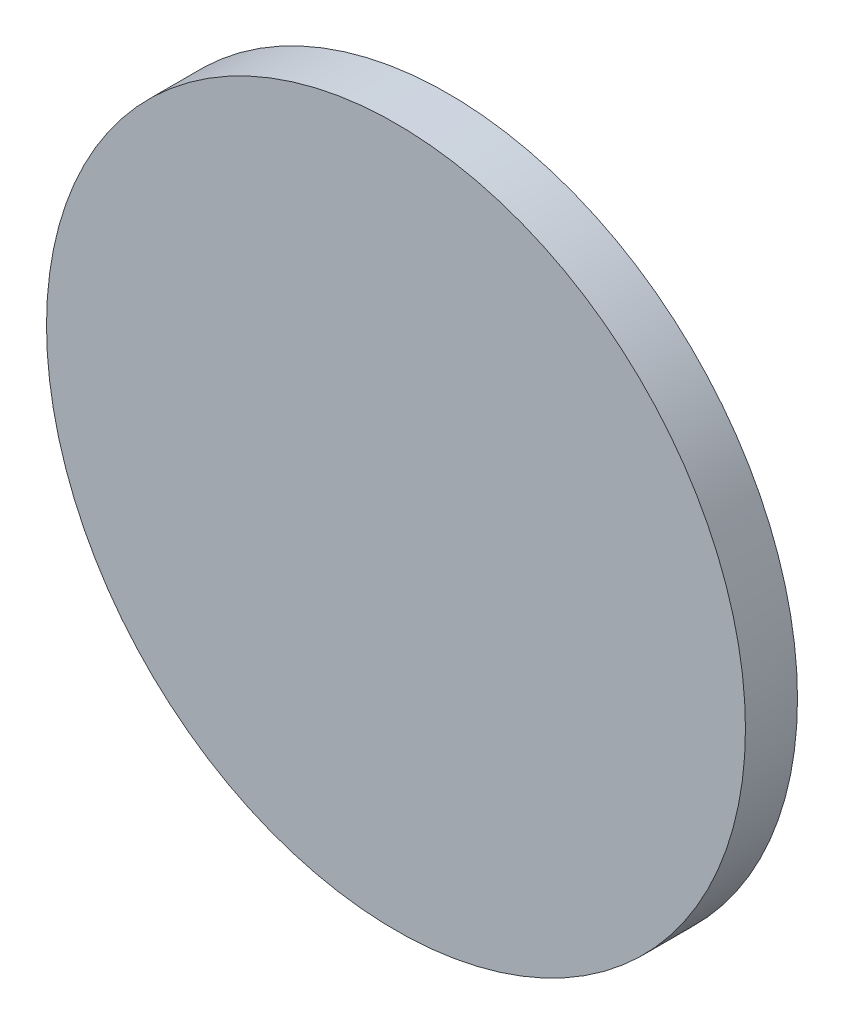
ISO-10303-21;
HEADER;
FILE_DESCRIPTION(('STEP AP214'),'2;1');
FILE_NAME('part.step','',(''),(''),'','','');
FILE_SCHEMA(('AUTOMOTIVE_DESIGN { 1 0 10303 214 1 1 1 1 }'));
ENDSEC;
DATA;
#1=APPLICATION_CONTEXT('core data for automotive mechanical design processes');
#2=APPLICATION_PROTOCOL_DEFINITION('international standard','automotive_design',2000,#1);
#3=PRODUCT_CONTEXT('',#1,'mechanical');
#4=PRODUCT('Part','Part','',(#3));
#5=PRODUCT_RELATED_PRODUCT_CATEGORY('part','',(#4));
#6=PRODUCT_DEFINITION_FORMATION('','',#4);
#7=PRODUCT_DEFINITION_CONTEXT('part definition',#1,'design');
#8=PRODUCT_DEFINITION('design','',#6,#7);
#9=PRODUCT_DEFINITION_SHAPE('','',#8);
#10=(LENGTH_UNIT() NAMED_UNIT(*) SI_UNIT(.MILLI.,.METRE.));
#11=(NAMED_UNIT(*) PLANE_ANGLE_UNIT() SI_UNIT($,.RADIAN.));
#12=(NAMED_UNIT(*) SI_UNIT($,.STERADIAN.) SOLID_ANGLE_UNIT());
#13=UNCERTAINTY_MEASURE_WITH_UNIT(LENGTH_MEASURE(1.E-05),#10,'distance_accuracy_value','');
#14=(GEOMETRIC_REPRESENTATION_CONTEXT(3) GLOBAL_UNCERTAINTY_ASSIGNED_CONTEXT((#13)) GLOBAL_UNIT_ASSIGNED_CONTEXT((#10,
#11,#12)) REPRESENTATION_CONTEXT('',''));
#15=CARTESIAN_POINT('',(0.,0.,0.));
#16=DIRECTION('',(0.,0.,1.));
#17=DIRECTION('',(1.,0.,0.));
#18=AXIS2_PLACEMENT_3D('',#15,#16,#17);
#19=CARTESIAN_POINT('',(0.,0.,1.4));
#20=DIRECTION('',(0.,0.,-1.));
#21=DIRECTION('',(-1.,0.,0.));
#22=AXIS2_PLACEMENT_3D('',#19,#20,#21);
#23=PLANE('',#22);
#24=CARTESIAN_POINT('',(0.,0.,1.4));
#25=DIRECTION('',(0.,0.,-1.));
#26=DIRECTION('',(-1.,0.,0.));
#27=AXIS2_PLACEMENT_3D('',#24,#25,#26);
#28=CIRCLE('',#27,12.830188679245);
#29=CARTESIAN_POINT('',(-12.830188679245,0.,1.4));
#30=VERTEX_POINT('',#29);
#31=EDGE_CURVE('E8',#30,#30,#28,.T.);
#32=ORIENTED_EDGE('',*,*,#31,.T.);
#33=EDGE_LOOP('',(#32));
#34=FACE_BOUND('',#33,.T.);
#35=ADVANCED_FACE('F12',(#34),#23,.T.);
#36=CARTESIAN_POINT('',(0.,0.,2.));
#37=DIRECTION('',(0.,0.,-1.));
#38=DIRECTION('',(-1.,0.,0.));
#39=AXIS2_PLACEMENT_3D('',#36,#37,#38);
#40=CYLINDRICAL_SURFACE('',#39,12.830188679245);
#41=CARTESIAN_POINT('',(0.,0.,0.));
#42=DIRECTION('',(0.,0.,-1.));
#43=DIRECTION('',(-1.,0.,0.));
#44=AXIS2_PLACEMENT_3D('',#41,#42,#43);
#45=CIRCLE('',#44,12.830188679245);
#46=CARTESIAN_POINT('',(-12.830188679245,0.,0.));
#47=VERTEX_POINT('',#46);
#48=EDGE_CURVE('E18',#47,#47,#45,.T.);
#49=ORIENTED_EDGE('',*,*,#48,.T.);
#50=EDGE_LOOP('',(#49));
#51=FACE_BOUND('',#50,.T.);
#52=ORIENTED_EDGE('',*,*,#31,.F.);
#53=EDGE_LOOP('',(#52));
#54=FACE_BOUND('',#53,.T.);
#55=ADVANCED_FACE('F45',(#51,#54),#40,.F.);
#56=CARTESIAN_POINT('',(0.,12.830188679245,0.));
#57=DIRECTION('',(0.,0.,-1.));
#58=DIRECTION('',(-1.,0.,0.));
#59=AXIS2_PLACEMENT_3D('',#56,#57,#58);
#60=PLANE('',#59);
#61=CARTESIAN_POINT('',(0.,0.,0.));
#62=DIRECTION('',(0.,0.,-1.));
#63=DIRECTION('',(-1.,0.,0.));
#64=AXIS2_PLACEMENT_3D('',#61,#62,#63);
#65=CIRCLE('',#64,13.430188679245);
#66=CARTESIAN_POINT('',(-13.430188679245,0.,0.));
#67=VERTEX_POINT('',#66);
#68=EDGE_CURVE('E22',#67,#67,#65,.T.);
#69=ORIENTED_EDGE('',*,*,#68,.T.);
#70=EDGE_LOOP('',(#69));
#71=FACE_BOUND('',#70,.T.);
#72=ORIENTED_EDGE('',*,*,#48,.F.);
#73=EDGE_LOOP('',(#72));
#74=FACE_BOUND('',#73,.T.);
#75=ADVANCED_FACE('F42',(#71,#74),#60,.T.);
#76=CARTESIAN_POINT('',(0.,0.,2.));
#77=DIRECTION('',(0.,0.,-1.));
#78=DIRECTION('',(-1.,0.,0.));
#79=AXIS2_PLACEMENT_3D('',#76,#77,#78);
#80=CYLINDRICAL_SURFACE('',#79,13.430188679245);
#81=CARTESIAN_POINT('',(0.,0.,2.));
#82=DIRECTION('',(0.,0.,-1.));
#83=DIRECTION('',(-1.,0.,0.));
#84=AXIS2_PLACEMENT_3D('',#81,#82,#83);
#85=CIRCLE('',#84,13.430188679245);
#86=CARTESIAN_POINT('',(-13.430188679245,0.,2.));
#87=VERTEX_POINT('',#86);
#88=EDGE_CURVE('E26',#87,#87,#85,.T.);
#89=ORIENTED_EDGE('',*,*,#88,.T.);
#90=EDGE_LOOP('',(#89));
#91=FACE_BOUND('',#90,.T.);
#92=ORIENTED_EDGE('',*,*,#68,.F.);
#93=EDGE_LOOP('',(#92));
#94=FACE_BOUND('',#93,.T.);
#95=ADVANCED_FACE('F32',(#91,#94),#80,.T.);
#96=CARTESIAN_POINT('',(0.,13.430188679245,2.));
#97=DIRECTION('',(0.,0.,1.));
#98=DIRECTION('',(1.,0.,0.));
#99=AXIS2_PLACEMENT_3D('',#96,#97,#98);
#100=PLANE('',#99);
#101=ORIENTED_EDGE('',*,*,#88,.F.);
#102=EDGE_LOOP('',(#101));
#103=FACE_BOUND('',#102,.T.);
#104=ADVANCED_FACE('F35',(#103),#100,.T.);
#105=CLOSED_SHELL('',(#35,#55,#75,#95,#104));
#106=MANIFOLD_SOLID_BREP('B1',#105);
#107=ADVANCED_BREP_SHAPE_REPRESENTATION('',(#18,#106),#14);
#108=SHAPE_DEFINITION_REPRESENTATION(#9,#107);
ENDSEC;
END-ISO-10303-21;
